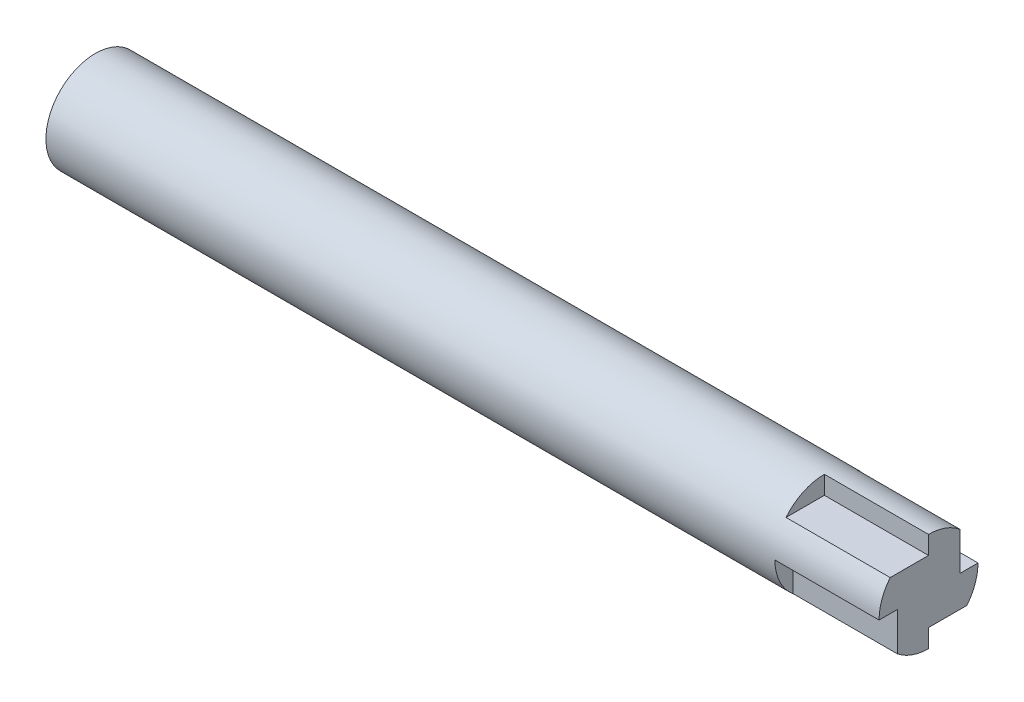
ISO-10303-21;
HEADER;
FILE_DESCRIPTION(('STEP AP214'),'2;1');
FILE_NAME('part.step','',(''),(''),'','','');
FILE_SCHEMA(('AUTOMOTIVE_DESIGN { 1 0 10303 214 1 1 1 1 }'));
ENDSEC;
DATA;
#1=APPLICATION_CONTEXT('core data for automotive mechanical design processes');
#2=APPLICATION_PROTOCOL_DEFINITION('international standard','automotive_design',2000,#1);
#3=PRODUCT_CONTEXT('',#1,'mechanical');
#4=PRODUCT('Part','Part','',(#3));
#5=PRODUCT_RELATED_PRODUCT_CATEGORY('part','',(#4));
#6=PRODUCT_DEFINITION_FORMATION('','',#4);
#7=PRODUCT_DEFINITION_CONTEXT('part definition',#1,'design');
#8=PRODUCT_DEFINITION('design','',#6,#7);
#9=PRODUCT_DEFINITION_SHAPE('','',#8);
#10=(LENGTH_UNIT() NAMED_UNIT(*) SI_UNIT(.MILLI.,.METRE.));
#11=(NAMED_UNIT(*) PLANE_ANGLE_UNIT() SI_UNIT($,.RADIAN.));
#12=(NAMED_UNIT(*) SI_UNIT($,.STERADIAN.) SOLID_ANGLE_UNIT());
#13=UNCERTAINTY_MEASURE_WITH_UNIT(LENGTH_MEASURE(1.E-05),#10,'distance_accuracy_value','');
#14=(GEOMETRIC_REPRESENTATION_CONTEXT(3) GLOBAL_UNCERTAINTY_ASSIGNED_CONTEXT((#13)) GLOBAL_UNIT_ASSIGNED_CONTEXT((#10,
#11,#12)) REPRESENTATION_CONTEXT('',''));
#15=CARTESIAN_POINT('',(0.,0.,0.));
#16=DIRECTION('',(0.,0.,1.));
#17=DIRECTION('',(1.,0.,0.));
#18=AXIS2_PLACEMENT_3D('',#15,#16,#17);
#19=CARTESIAN_POINT('',(203.2,0.,0.));
#20=DIRECTION('',(-1.,0.,0.));
#21=DIRECTION('',(0.,0.,1.));
#22=AXIS2_PLACEMENT_3D('',#19,#20,#21);
#23=CYLINDRICAL_SURFACE('',#22,12.065);
#24=CARTESIAN_POINT('',(177.8,0.,0.));
#25=DIRECTION('',(1.,0.,0.));
#26=DIRECTION('',(0.,1.,0.));
#27=AXIS2_PLACEMENT_3D('',#24,#25,#26);
#28=CIRCLE('',#27,12.065);
#29=CARTESIAN_POINT('',(177.8,0.,12.065));
#30=VERTEX_POINT('',#29);
#31=CARTESIAN_POINT('',(177.8,-9.35413411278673,7.61999999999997));
#32=VERTEX_POINT('',#31);
#33=EDGE_CURVE('E158',#30,#32,#28,.T.);
#34=ORIENTED_EDGE('',*,*,#33,.F.);
#35=DIRECTION('',(1.,0.,0.));
#36=VECTOR('',#35,1.);
#37=CARTESIAN_POINT('',(177.8,0.,12.065));
#38=LINE('',#37,#36);
#39=CARTESIAN_POINT('',(203.2,0.,12.065));
#40=VERTEX_POINT('',#39);
#41=EDGE_CURVE('E143',#30,#40,#38,.T.);
#42=ORIENTED_EDGE('',*,*,#41,.T.);
#43=CARTESIAN_POINT('',(203.2,0.,0.));
#44=DIRECTION('',(1.,0.,0.));
#45=DIRECTION('',(0.,0.,-1.));
#46=AXIS2_PLACEMENT_3D('',#43,#44,#45);
#47=CIRCLE('',#46,12.065);
#48=CARTESIAN_POINT('',(203.2,7.62,9.35413411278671));
#49=VERTEX_POINT('',#48);
#50=EDGE_CURVE('E13',#49,#40,#47,.T.);
#51=ORIENTED_EDGE('',*,*,#50,.F.);
#52=DIRECTION('',(1.,0.,0.));
#53=VECTOR('',#52,1.);
#54=CARTESIAN_POINT('',(177.8,7.62,9.35413411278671));
#55=LINE('',#54,#53);
#56=CARTESIAN_POINT('',(177.8,7.62,9.35413411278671));
#57=VERTEX_POINT('',#56);
#58=EDGE_CURVE('E227',#57,#49,#55,.T.);
#59=ORIENTED_EDGE('',*,*,#58,.F.);
#60=CARTESIAN_POINT('',(177.8,0.,0.));
#61=DIRECTION('',(1.,0.,0.));
#62=DIRECTION('',(0.,0.,-1.));
#63=AXIS2_PLACEMENT_3D('',#60,#61,#62);
#64=CIRCLE('',#63,12.065);
#65=CARTESIAN_POINT('',(177.8,12.065,0.));
#66=VERTEX_POINT('',#65);
#67=EDGE_CURVE('E214',#66,#57,#64,.T.);
#68=ORIENTED_EDGE('',*,*,#67,.F.);
#69=DIRECTION('',(1.,0.,0.));
#70=VECTOR('',#69,1.);
#71=CARTESIAN_POINT('',(177.8,12.065,0.));
#72=LINE('',#71,#70);
#73=CARTESIAN_POINT('',(203.2,12.065,0.));
#74=VERTEX_POINT('',#73);
#75=EDGE_CURVE('E220',#66,#74,#72,.T.);
#76=ORIENTED_EDGE('',*,*,#75,.T.);
#77=CARTESIAN_POINT('',(203.2,9.35413411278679,-7.6199999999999));
#78=VERTEX_POINT('',#77);
#79=EDGE_CURVE('E58',#78,#74,#47,.T.);
#80=ORIENTED_EDGE('',*,*,#79,.F.);
#81=DIRECTION('',(1.,0.,0.));
#82=VECTOR('',#81,1.);
#83=CARTESIAN_POINT('',(177.8,9.35413411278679,-7.6199999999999));
#84=LINE('',#83,#82);
#85=CARTESIAN_POINT('',(177.8,9.35413411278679,-7.6199999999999));
#86=VERTEX_POINT('',#85);
#87=EDGE_CURVE('E65',#86,#78,#84,.T.);
#88=ORIENTED_EDGE('',*,*,#87,.F.);
#89=CARTESIAN_POINT('',(177.8,0.,0.));
#90=DIRECTION('',(1.,0.,0.));
#91=DIRECTION('',(0.,-1.,0.));
#92=AXIS2_PLACEMENT_3D('',#89,#90,#91);
#93=CIRCLE('',#92,12.065);
#94=CARTESIAN_POINT('',(177.8,1.25635398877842E-13,-12.065));
#95=VERTEX_POINT('',#94);
#96=EDGE_CURVE('E197',#95,#86,#93,.T.);
#97=ORIENTED_EDGE('',*,*,#96,.F.);
#98=DIRECTION('',(1.,0.,0.));
#99=VECTOR('',#98,1.);
#100=CARTESIAN_POINT('',(177.8,1.25635398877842E-13,-12.065));
#101=LINE('',#100,#99);
#102=CARTESIAN_POINT('',(203.2,1.25635398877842E-13,-12.065));
#103=VERTEX_POINT('',#102);
#104=EDGE_CURVE('E203',#95,#103,#101,.T.);
#105=ORIENTED_EDGE('',*,*,#104,.T.);
#106=CARTESIAN_POINT('',(203.2,-7.62,-9.35413411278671));
#107=VERTEX_POINT('',#106);
#108=EDGE_CURVE('E247',#107,#103,#47,.T.);
#109=ORIENTED_EDGE('',*,*,#108,.F.);
#110=DIRECTION('',(1.,0.,0.));
#111=VECTOR('',#110,1.);
#112=CARTESIAN_POINT('',(177.8,-7.62,-9.35413411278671));
#113=LINE('',#112,#111);
#114=CARTESIAN_POINT('',(177.8,-7.62,-9.35413411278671));
#115=VERTEX_POINT('',#114);
#116=EDGE_CURVE('E73',#115,#107,#113,.T.);
#117=ORIENTED_EDGE('',*,*,#116,.F.);
#118=CARTESIAN_POINT('',(177.8,0.,0.));
#119=DIRECTION('',(1.,0.,0.));
#120=DIRECTION('',(0.,0.,1.));
#121=AXIS2_PLACEMENT_3D('',#118,#119,#120);
#122=CIRCLE('',#121,12.065);
#123=CARTESIAN_POINT('',(177.8,-12.065,0.));
#124=VERTEX_POINT('',#123);
#125=EDGE_CURVE('E179',#124,#115,#122,.T.);
#126=ORIENTED_EDGE('',*,*,#125,.F.);
#127=DIRECTION('',(1.,0.,0.));
#128=VECTOR('',#127,1.);
#129=CARTESIAN_POINT('',(177.8,-12.065,0.));
#130=LINE('',#129,#128);
#131=CARTESIAN_POINT('',(203.2,-12.065,0.));
#132=VERTEX_POINT('',#131);
#133=EDGE_CURVE('E185',#124,#132,#130,.T.);
#134=ORIENTED_EDGE('',*,*,#133,.T.);
#135=CARTESIAN_POINT('',(203.2,-9.35413411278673,7.61999999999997));
#136=VERTEX_POINT('',#135);
#137=EDGE_CURVE('E57',#136,#132,#47,.T.);
#138=ORIENTED_EDGE('',*,*,#137,.F.);
#139=DIRECTION('',(1.,0.,0.));
#140=VECTOR('',#139,1.);
#141=CARTESIAN_POINT('',(177.8,-9.35413411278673,7.61999999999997));
#142=LINE('',#141,#140);
#143=EDGE_CURVE('E153',#32,#136,#142,.T.);
#144=ORIENTED_EDGE('',*,*,#143,.F.);
#145=EDGE_LOOP('',(#34,#42,#51,#59,#68,#76,#80,#88,#97,#105,#109,#117,#126,#134,#138,#144));
#146=FACE_BOUND('',#145,.T.);
#147=CARTESIAN_POINT('',(0.,0.,0.));
#148=DIRECTION('',(1.,0.,0.));
#149=DIRECTION('',(0.,0.,-1.));
#150=AXIS2_PLACEMENT_3D('',#147,#148,#149);
#151=CIRCLE('',#150,12.065);
#152=CARTESIAN_POINT('',(0.,0.,-12.065));
#153=VERTEX_POINT('',#152);
#154=EDGE_CURVE('E52',#153,#153,#151,.T.);
#155=ORIENTED_EDGE('',*,*,#154,.T.);
#156=EDGE_LOOP('',(#155));
#157=FACE_BOUND('',#156,.T.);
#158=ADVANCED_FACE('F49',(#146,#157),#23,.T.);
#159=CARTESIAN_POINT('',(203.2,0.,0.));
#160=DIRECTION('',(1.,0.,0.));
#161=DIRECTION('',(0.,0.,-1.));
#162=AXIS2_PLACEMENT_3D('',#159,#160,#161);
#163=PLANE('',#162);
#164=DIRECTION('',(0.,0.,1.));
#165=VECTOR('',#164,1.);
#166=CARTESIAN_POINT('',(203.2,0.,12.065));
#167=LINE('',#166,#165);
#168=CARTESIAN_POINT('',(203.2,0.,7.62));
#169=VERTEX_POINT('',#168);
#170=EDGE_CURVE('E149',#169,#40,#167,.T.);
#171=ORIENTED_EDGE('',*,*,#170,.F.);
#172=DIRECTION('',(0.,1.,0.));
#173=VECTOR('',#172,1.);
#174=CARTESIAN_POINT('',(203.2,-9.35413411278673,7.61999999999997));
#175=LINE('',#174,#173);
#176=EDGE_CURVE('E160',#136,#169,#175,.T.);
#177=ORIENTED_EDGE('',*,*,#176,.F.);
#178=ORIENTED_EDGE('',*,*,#137,.T.);
#179=DIRECTION('',(0.,-1.,0.));
#180=VECTOR('',#179,1.);
#181=CARTESIAN_POINT('',(203.2,-12.065,0.));
#182=LINE('',#181,#180);
#183=CARTESIAN_POINT('',(203.2,-7.62,0.));
#184=VERTEX_POINT('',#183);
#185=EDGE_CURVE('E186',#184,#132,#182,.T.);
#186=ORIENTED_EDGE('',*,*,#185,.F.);
#187=DIRECTION('',(0.,0.,1.));
#188=VECTOR('',#187,1.);
#189=CARTESIAN_POINT('',(203.2,-7.62,-9.35413411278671));
#190=LINE('',#189,#188);
#191=EDGE_CURVE('E180',#107,#184,#190,.T.);
#192=ORIENTED_EDGE('',*,*,#191,.F.);
#193=ORIENTED_EDGE('',*,*,#108,.T.);
#194=DIRECTION('',(0.,0.,-1.));
#195=VECTOR('',#194,1.);
#196=CARTESIAN_POINT('',(203.2,1.25981143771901E-13,-12.065));
#197=LINE('',#196,#195);
#198=CARTESIAN_POINT('',(203.2,0.,-7.62));
#199=VERTEX_POINT('',#198);
#200=EDGE_CURVE('E204',#199,#103,#197,.T.);
#201=ORIENTED_EDGE('',*,*,#200,.F.);
#202=DIRECTION('',(0.,-1.,0.));
#203=VECTOR('',#202,1.);
#204=CARTESIAN_POINT('',(203.2,9.35413411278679,-7.6199999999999));
#205=LINE('',#204,#203);
#206=EDGE_CURVE('E198',#78,#199,#205,.T.);
#207=ORIENTED_EDGE('',*,*,#206,.F.);
#208=ORIENTED_EDGE('',*,*,#79,.T.);
#209=DIRECTION('',(0.,1.,0.));
#210=VECTOR('',#209,1.);
#211=CARTESIAN_POINT('',(203.2,12.065,0.));
#212=LINE('',#211,#210);
#213=CARTESIAN_POINT('',(203.2,7.62,0.));
#214=VERTEX_POINT('',#213);
#215=EDGE_CURVE('E174',#214,#74,#212,.T.);
#216=ORIENTED_EDGE('',*,*,#215,.F.);
#217=DIRECTION('',(0.,0.,-1.));
#218=VECTOR('',#217,1.);
#219=CARTESIAN_POINT('',(203.2,7.62,9.35413411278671));
#220=LINE('',#219,#218);
#221=EDGE_CURVE('E215',#49,#214,#220,.T.);
#222=ORIENTED_EDGE('',*,*,#221,.F.);
#223=ORIENTED_EDGE('',*,*,#50,.T.);
#224=EDGE_LOOP('',(#171,#177,#178,#186,#192,#193,#201,#207,#208,#216,#222,#223));
#225=FACE_BOUND('',#224,.T.);
#226=ADVANCED_FACE('F244',(#225),#163,.T.);
#227=CARTESIAN_POINT('',(0.,0.,0.));
#228=DIRECTION('',(1.,0.,0.));
#229=DIRECTION('',(0.,0.,-1.));
#230=AXIS2_PLACEMENT_3D('',#227,#228,#229);
#231=PLANE('',#230);
#232=ORIENTED_EDGE('',*,*,#154,.F.);
#233=EDGE_LOOP('',(#232));
#234=FACE_BOUND('',#233,.T.);
#235=ADVANCED_FACE('F252',(#234),#231,.F.);
#236=CARTESIAN_POINT('',(177.8,12.065,0.));
#237=DIRECTION('',(0.,0.,-1.));
#238=DIRECTION('',(0.,1.,0.));
#239=AXIS2_PLACEMENT_3D('',#236,#237,#238);
#240=PLANE('',#239);
#241=ORIENTED_EDGE('',*,*,#215,.T.);
#242=ORIENTED_EDGE('',*,*,#75,.F.);
#243=DIRECTION('',(0.,1.,0.));
#244=VECTOR('',#243,1.);
#245=CARTESIAN_POINT('',(177.8,12.065,0.));
#246=LINE('',#245,#244);
#247=CARTESIAN_POINT('',(177.8,7.62,0.));
#248=VERTEX_POINT('',#247);
#249=EDGE_CURVE('E211',#248,#66,#246,.T.);
#250=ORIENTED_EDGE('',*,*,#249,.F.);
#251=DIRECTION('',(1.,0.,0.));
#252=VECTOR('',#251,1.);
#253=CARTESIAN_POINT('',(177.8,7.62,0.));
#254=LINE('',#253,#252);
#255=EDGE_CURVE('E225',#248,#214,#254,.T.);
#256=ORIENTED_EDGE('',*,*,#255,.T.);
#257=EDGE_LOOP('',(#241,#242,#250,#256));
#258=FACE_BOUND('',#257,.T.);
#259=ADVANCED_FACE('F235',(#258),#240,.F.);
#260=CARTESIAN_POINT('',(177.8,7.62,9.35413411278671));
#261=DIRECTION('',(0.,-1.,0.));
#262=DIRECTION('',(0.,0.,-1.));
#263=AXIS2_PLACEMENT_3D('',#260,#261,#262);
#264=PLANE('',#263);
#265=ORIENTED_EDGE('',*,*,#221,.T.);
#266=ORIENTED_EDGE('',*,*,#255,.F.);
#267=DIRECTION('',(0.,0.,-1.));
#268=VECTOR('',#267,1.);
#269=CARTESIAN_POINT('',(177.8,7.62,9.35413411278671));
#270=LINE('',#269,#268);
#271=EDGE_CURVE('E217',#57,#248,#270,.T.);
#272=ORIENTED_EDGE('',*,*,#271,.F.);
#273=ORIENTED_EDGE('',*,*,#58,.T.);
#274=EDGE_LOOP('',(#265,#266,#272,#273));
#275=FACE_BOUND('',#274,.T.);
#276=ADVANCED_FACE('F241',(#275),#264,.F.);
#277=CARTESIAN_POINT('',(177.8,0.,0.));
#278=DIRECTION('',(1.,0.,0.));
#279=DIRECTION('',(0.,0.,-1.));
#280=AXIS2_PLACEMENT_3D('',#277,#278,#279);
#281=PLANE('',#280);
#282=ORIENTED_EDGE('',*,*,#249,.T.);
#283=ORIENTED_EDGE('',*,*,#67,.T.);
#284=ORIENTED_EDGE('',*,*,#271,.T.);
#285=EDGE_LOOP('',(#282,#283,#284));
#286=FACE_BOUND('',#285,.T.);
#287=ADVANCED_FACE('F238',(#286),#281,.T.);
#288=CARTESIAN_POINT('',(177.8,1.25981143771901E-13,-12.065));
#289=DIRECTION('',(0.,-1.,0.));
#290=DIRECTION('',(0.,0.,-1.));
#291=AXIS2_PLACEMENT_3D('',#288,#289,#290);
#292=PLANE('',#291);
#293=ORIENTED_EDGE('',*,*,#200,.T.);
#294=ORIENTED_EDGE('',*,*,#104,.F.);
#295=DIRECTION('',(0.,0.,-1.));
#296=VECTOR('',#295,1.);
#297=CARTESIAN_POINT('',(177.8,1.25981143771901E-13,-12.065));
#298=LINE('',#297,#296);
#299=CARTESIAN_POINT('',(177.8,0.,-7.62));
#300=VERTEX_POINT('',#299);
#301=EDGE_CURVE('E194',#300,#95,#298,.T.);
#302=ORIENTED_EDGE('',*,*,#301,.F.);
#303=DIRECTION('',(1.,0.,0.));
#304=VECTOR('',#303,1.);
#305=CARTESIAN_POINT('',(177.8,0.,-7.62));
#306=LINE('',#305,#304);
#307=EDGE_CURVE('E188',#300,#199,#306,.T.);
#308=ORIENTED_EDGE('',*,*,#307,.T.);
#309=EDGE_LOOP('',(#293,#294,#302,#308));
#310=FACE_BOUND('',#309,.T.);
#311=ADVANCED_FACE('F274',(#310),#292,.F.);
#312=CARTESIAN_POINT('',(177.8,9.35413411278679,-7.6199999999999));
#313=DIRECTION('',(0.,0.,1.));
#314=DIRECTION('',(0.,-1.,0.));
#315=AXIS2_PLACEMENT_3D('',#312,#313,#314);
#316=PLANE('',#315);
#317=ORIENTED_EDGE('',*,*,#206,.T.);
#318=ORIENTED_EDGE('',*,*,#307,.F.);
#319=DIRECTION('',(0.,-1.,0.));
#320=VECTOR('',#319,1.);
#321=CARTESIAN_POINT('',(177.8,9.35413411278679,-7.6199999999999));
#322=LINE('',#321,#320);
#323=EDGE_CURVE('E200',#86,#300,#322,.T.);
#324=ORIENTED_EDGE('',*,*,#323,.F.);
#325=ORIENTED_EDGE('',*,*,#87,.T.);
#326=EDGE_LOOP('',(#317,#318,#324,#325));
#327=FACE_BOUND('',#326,.T.);
#328=ADVANCED_FACE('F279',(#327),#316,.F.);
#329=CARTESIAN_POINT('',(177.8,0.,0.));
#330=DIRECTION('',(1.,0.,0.));
#331=DIRECTION('',(0.,-1.,0.));
#332=AXIS2_PLACEMENT_3D('',#329,#330,#331);
#333=PLANE('',#332);
#334=ORIENTED_EDGE('',*,*,#301,.T.);
#335=ORIENTED_EDGE('',*,*,#96,.T.);
#336=ORIENTED_EDGE('',*,*,#323,.T.);
#337=EDGE_LOOP('',(#334,#335,#336));
#338=FACE_BOUND('',#337,.T.);
#339=ADVANCED_FACE('F291',(#338),#333,.T.);
#340=CARTESIAN_POINT('',(177.8,-12.065,0.));
#341=DIRECTION('',(0.,0.,1.));
#342=DIRECTION('',(0.,-1.,0.));
#343=AXIS2_PLACEMENT_3D('',#340,#341,#342);
#344=PLANE('',#343);
#345=ORIENTED_EDGE('',*,*,#185,.T.);
#346=ORIENTED_EDGE('',*,*,#133,.F.);
#347=DIRECTION('',(0.,-1.,0.));
#348=VECTOR('',#347,1.);
#349=CARTESIAN_POINT('',(177.8,-12.065,0.));
#350=LINE('',#349,#348);
#351=CARTESIAN_POINT('',(177.8,-7.62,0.));
#352=VERTEX_POINT('',#351);
#353=EDGE_CURVE('E176',#352,#124,#350,.T.);
#354=ORIENTED_EDGE('',*,*,#353,.F.);
#355=DIRECTION('',(1.,0.,0.));
#356=VECTOR('',#355,1.);
#357=CARTESIAN_POINT('',(177.8,-7.62,0.));
#358=LINE('',#357,#356);
#359=EDGE_CURVE('E169',#352,#184,#358,.T.);
#360=ORIENTED_EDGE('',*,*,#359,.T.);
#361=EDGE_LOOP('',(#345,#346,#354,#360));
#362=FACE_BOUND('',#361,.T.);
#363=ADVANCED_FACE('F300',(#362),#344,.F.);
#364=CARTESIAN_POINT('',(177.8,-7.62,-9.35413411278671));
#365=DIRECTION('',(0.,1.,0.));
#366=DIRECTION('',(0.,0.,1.));
#367=AXIS2_PLACEMENT_3D('',#364,#365,#366);
#368=PLANE('',#367);
#369=ORIENTED_EDGE('',*,*,#191,.T.);
#370=ORIENTED_EDGE('',*,*,#359,.F.);
#371=DIRECTION('',(0.,0.,1.));
#372=VECTOR('',#371,1.);
#373=CARTESIAN_POINT('',(177.8,-7.62,-9.35413411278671));
#374=LINE('',#373,#372);
#375=EDGE_CURVE('E182',#115,#352,#374,.T.);
#376=ORIENTED_EDGE('',*,*,#375,.F.);
#377=ORIENTED_EDGE('',*,*,#116,.T.);
#378=EDGE_LOOP('',(#369,#370,#376,#377));
#379=FACE_BOUND('',#378,.T.);
#380=ADVANCED_FACE('F310',(#379),#368,.F.);
#381=CARTESIAN_POINT('',(177.8,0.,0.));
#382=DIRECTION('',(1.,0.,0.));
#383=DIRECTION('',(0.,0.,1.));
#384=AXIS2_PLACEMENT_3D('',#381,#382,#383);
#385=PLANE('',#384);
#386=ORIENTED_EDGE('',*,*,#353,.T.);
#387=ORIENTED_EDGE('',*,*,#125,.T.);
#388=ORIENTED_EDGE('',*,*,#375,.T.);
#389=EDGE_LOOP('',(#386,#387,#388));
#390=FACE_BOUND('',#389,.T.);
#391=ADVANCED_FACE('F320',(#390),#385,.T.);
#392=CARTESIAN_POINT('',(177.8,0.,12.065));
#393=DIRECTION('',(0.,1.,0.));
#394=DIRECTION('',(0.,0.,1.));
#395=AXIS2_PLACEMENT_3D('',#392,#393,#394);
#396=PLANE('',#395);
#397=ORIENTED_EDGE('',*,*,#170,.T.);
#398=ORIENTED_EDGE('',*,*,#41,.F.);
#399=DIRECTION('',(0.,0.,1.));
#400=VECTOR('',#399,1.);
#401=CARTESIAN_POINT('',(177.8,0.,12.065));
#402=LINE('',#401,#400);
#403=CARTESIAN_POINT('',(177.8,0.,7.62));
#404=VERTEX_POINT('',#403);
#405=EDGE_CURVE('E146',#404,#30,#402,.T.);
#406=ORIENTED_EDGE('',*,*,#405,.F.);
#407=DIRECTION('',(1.,0.,0.));
#408=VECTOR('',#407,1.);
#409=CARTESIAN_POINT('',(177.8,0.,7.62));
#410=LINE('',#409,#408);
#411=EDGE_CURVE('E172',#404,#169,#410,.T.);
#412=ORIENTED_EDGE('',*,*,#411,.T.);
#413=EDGE_LOOP('',(#397,#398,#406,#412));
#414=FACE_BOUND('',#413,.T.);
#415=ADVANCED_FACE('F145',(#414),#396,.F.);
#416=CARTESIAN_POINT('',(177.8,-9.35413411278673,7.61999999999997));
#417=DIRECTION('',(0.,0.,-1.));
#418=DIRECTION('',(0.,1.,0.));
#419=AXIS2_PLACEMENT_3D('',#416,#417,#418);
#420=PLANE('',#419);
#421=ORIENTED_EDGE('',*,*,#176,.T.);
#422=ORIENTED_EDGE('',*,*,#411,.F.);
#423=DIRECTION('',(0.,1.,0.));
#424=VECTOR('',#423,1.);
#425=CARTESIAN_POINT('',(177.8,-9.35413411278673,7.61999999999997));
#426=LINE('',#425,#424);
#427=EDGE_CURVE('E154',#32,#404,#426,.T.);
#428=ORIENTED_EDGE('',*,*,#427,.F.);
#429=ORIENTED_EDGE('',*,*,#143,.T.);
#430=EDGE_LOOP('',(#421,#422,#428,#429));
#431=FACE_BOUND('',#430,.T.);
#432=ADVANCED_FACE('F338',(#431),#420,.F.);
#433=CARTESIAN_POINT('',(177.8,0.,0.));
#434=DIRECTION('',(1.,0.,0.));
#435=DIRECTION('',(0.,1.,0.));
#436=AXIS2_PLACEMENT_3D('',#433,#434,#435);
#437=PLANE('',#436);
#438=ORIENTED_EDGE('',*,*,#405,.T.);
#439=ORIENTED_EDGE('',*,*,#33,.T.);
#440=ORIENTED_EDGE('',*,*,#427,.T.);
#441=EDGE_LOOP('',(#438,#439,#440));
#442=FACE_BOUND('',#441,.T.);
#443=ADVANCED_FACE('F157',(#442),#437,.T.);
#444=CLOSED_SHELL('',(#158,#226,#235,#259,#276,#287,#311,#328,#339,#363,#380,#391,#415,#432,#443));
#445=MANIFOLD_SOLID_BREP('B2',#444);
#446=ADVANCED_BREP_SHAPE_REPRESENTATION('',(#18,#445),#14);
#447=SHAPE_DEFINITION_REPRESENTATION(#9,#446);
ENDSEC;
END-ISO-10303-21;
